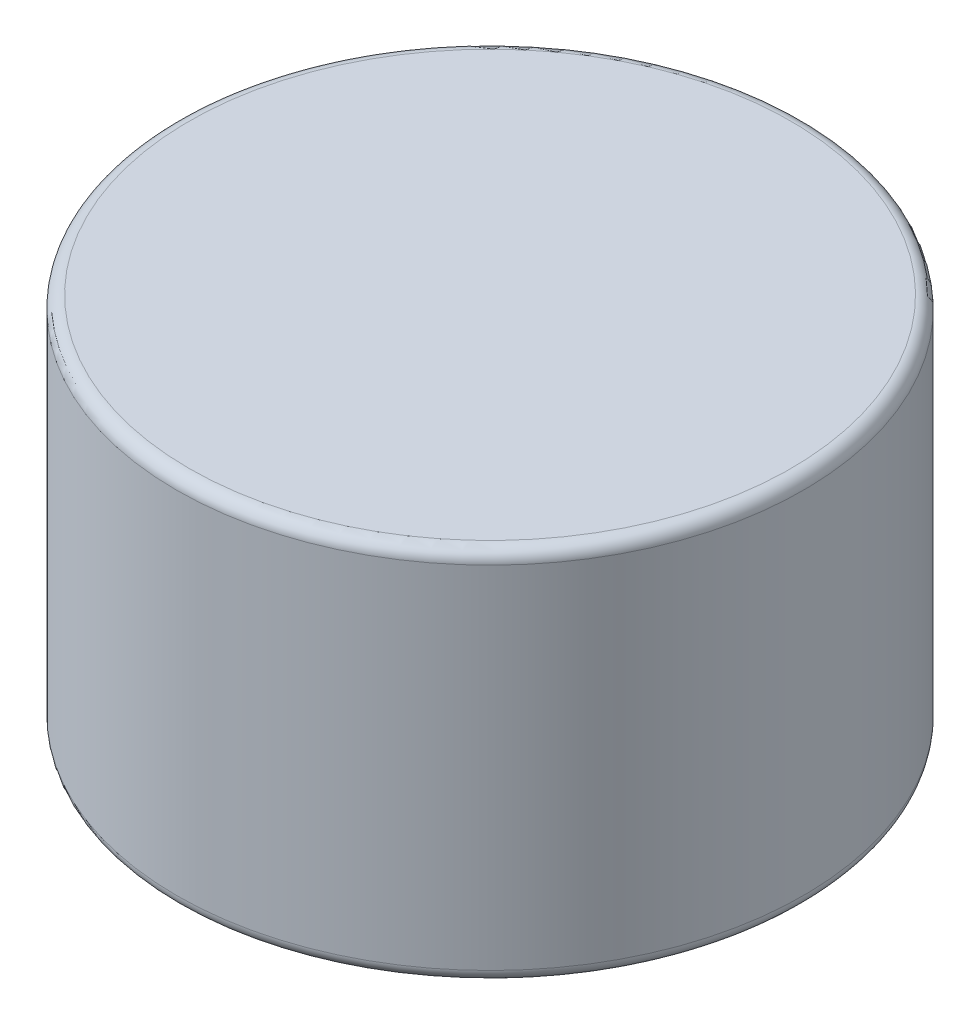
ISO-10303-21;
HEADER;
FILE_DESCRIPTION(('STEP AP214'),'2;1');
FILE_NAME('part.step','',(''),(''),'','','');
FILE_SCHEMA(('AUTOMOTIVE_DESIGN { 1 0 10303 214 1 1 1 1 }'));
ENDSEC;
DATA;
#1=APPLICATION_CONTEXT('core data for automotive mechanical design processes');
#2=APPLICATION_PROTOCOL_DEFINITION('international standard','automotive_design',2000,#1);
#3=PRODUCT_CONTEXT('',#1,'mechanical');
#4=PRODUCT('Part','Part','',(#3));
#5=PRODUCT_RELATED_PRODUCT_CATEGORY('part','',(#4));
#6=PRODUCT_DEFINITION_FORMATION('','',#4);
#7=PRODUCT_DEFINITION_CONTEXT('part definition',#1,'design');
#8=PRODUCT_DEFINITION('design','',#6,#7);
#9=PRODUCT_DEFINITION_SHAPE('','',#8);
#10=(LENGTH_UNIT() NAMED_UNIT(*) SI_UNIT(.MILLI.,.METRE.));
#11=(NAMED_UNIT(*) PLANE_ANGLE_UNIT() SI_UNIT($,.RADIAN.));
#12=(NAMED_UNIT(*) SI_UNIT($,.STERADIAN.) SOLID_ANGLE_UNIT());
#13=UNCERTAINTY_MEASURE_WITH_UNIT(LENGTH_MEASURE(1.E-05),#10,'distance_accuracy_value','');
#14=(GEOMETRIC_REPRESENTATION_CONTEXT(3) GLOBAL_UNCERTAINTY_ASSIGNED_CONTEXT((#13)) GLOBAL_UNIT_ASSIGNED_CONTEXT((#10,
#11,#12)) REPRESENTATION_CONTEXT('',''));
#15=CARTESIAN_POINT('',(0.,0.,0.));
#16=DIRECTION('',(0.,0.,1.));
#17=DIRECTION('',(1.,0.,0.));
#18=AXIS2_PLACEMENT_3D('',#15,#16,#17);
#19=CARTESIAN_POINT('',(0.,3.,0.));
#20=DIRECTION('',(0.,-1.,0.));
#21=DIRECTION('',(0.,0.,-1.));
#22=AXIS2_PLACEMENT_3D('',#19,#20,#21);
#23=CYLINDRICAL_SURFACE('',#22,2.5);
#24=CARTESIAN_POINT('',(0.,0.0999999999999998,0.));
#25=DIRECTION('',(0.,1.,0.));
#26=DIRECTION('',(0.,0.,1.));
#27=AXIS2_PLACEMENT_3D('',#24,#25,#26);
#28=CIRCLE('',#27,2.5);
#29=CARTESIAN_POINT('',(0.,0.0999999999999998,2.5));
#30=VERTEX_POINT('',#29);
#31=EDGE_CURVE('E44',#30,#30,#28,.T.);
#32=ORIENTED_EDGE('',*,*,#31,.T.);
#33=EDGE_LOOP('',(#32));
#34=FACE_BOUND('',#33,.T.);
#35=CARTESIAN_POINT('',(0.,2.9,0.));
#36=DIRECTION('',(0.,1.,0.));
#37=DIRECTION('',(0.,0.,1.));
#38=AXIS2_PLACEMENT_3D('',#35,#36,#37);
#39=CIRCLE('',#38,2.5);
#40=CARTESIAN_POINT('',(0.,2.9,2.5));
#41=VERTEX_POINT('',#40);
#42=EDGE_CURVE('E48',#41,#41,#39,.F.);
#43=ORIENTED_EDGE('',*,*,#42,.T.);
#44=EDGE_LOOP('',(#43));
#45=FACE_BOUND('',#44,.T.);
#46=ADVANCED_FACE('F33',(#34,#45),#23,.T.);
#47=CARTESIAN_POINT('',(0.,3.,0.));
#48=DIRECTION('',(0.,1.,0.));
#49=DIRECTION('',(0.,0.,1.));
#50=AXIS2_PLACEMENT_3D('',#47,#48,#49);
#51=PLANE('',#50);
#52=CARTESIAN_POINT('',(0.,3.,0.));
#53=DIRECTION('',(0.,1.,0.));
#54=DIRECTION('',(0.,0.,1.));
#55=AXIS2_PLACEMENT_3D('',#52,#53,#54);
#56=CIRCLE('',#55,2.4);
#57=CARTESIAN_POINT('',(0.,3.,2.4));
#58=VERTEX_POINT('',#57);
#59=EDGE_CURVE('E10',#58,#58,#56,.T.);
#60=ORIENTED_EDGE('',*,*,#59,.T.);
#61=EDGE_LOOP('',(#60));
#62=FACE_BOUND('',#61,.T.);
#63=ADVANCED_FACE('F64',(#62),#51,.T.);
#64=CARTESIAN_POINT('',(0.,0.,0.));
#65=DIRECTION('',(0.,1.,0.));
#66=DIRECTION('',(0.,0.,1.));
#67=AXIS2_PLACEMENT_3D('',#64,#65,#66);
#68=PLANE('',#67);
#69=CARTESIAN_POINT('',(0.,0.,0.));
#70=DIRECTION('',(0.,1.,0.));
#71=DIRECTION('',(0.,0.,1.));
#72=AXIS2_PLACEMENT_3D('',#69,#70,#71);
#73=CIRCLE('',#72,2.4);
#74=CARTESIAN_POINT('',(0.,0.,2.4));
#75=VERTEX_POINT('',#74);
#76=EDGE_CURVE('E40',#75,#75,#73,.F.);
#77=ORIENTED_EDGE('',*,*,#76,.T.);
#78=EDGE_LOOP('',(#77));
#79=FACE_BOUND('',#78,.T.);
#80=ADVANCED_FACE('F61',(#79),#68,.F.);
#81=CARTESIAN_POINT('',(0.,0.0999999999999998,0.));
#82=DIRECTION('',(0.,1.,0.));
#83=DIRECTION('',(0.,0.,1.));
#84=AXIS2_PLACEMENT_3D('',#81,#82,#83);
#85=TOROIDAL_SURFACE('',#84,2.4,0.1);
#86=ORIENTED_EDGE('',*,*,#76,.F.);
#87=EDGE_LOOP('',(#86));
#88=FACE_BOUND('',#87,.T.);
#89=ORIENTED_EDGE('',*,*,#31,.F.);
#90=EDGE_LOOP('',(#89));
#91=FACE_BOUND('',#90,.T.);
#92=ADVANCED_FACE('F57',(#88,#91),#85,.T.);
#93=CARTESIAN_POINT('',(0.,2.9,0.));
#94=DIRECTION('',(0.,1.,0.));
#95=DIRECTION('',(0.,0.,1.));
#96=AXIS2_PLACEMENT_3D('',#93,#94,#95);
#97=TOROIDAL_SURFACE('',#96,2.4,0.1);
#98=ORIENTED_EDGE('',*,*,#42,.F.);
#99=EDGE_LOOP('',(#98));
#100=FACE_BOUND('',#99,.T.);
#101=ORIENTED_EDGE('',*,*,#59,.F.);
#102=EDGE_LOOP('',(#101));
#103=FACE_BOUND('',#102,.T.);
#104=ADVANCED_FACE('F35',(#100,#103),#97,.T.);
#105=CLOSED_SHELL('',(#46,#63,#80,#92,#104));
#106=MANIFOLD_SOLID_BREP('B2',#105);
#107=ADVANCED_BREP_SHAPE_REPRESENTATION('',(#18,#106),#14);
#108=SHAPE_DEFINITION_REPRESENTATION(#9,#107);
ENDSEC;
END-ISO-10303-21;
